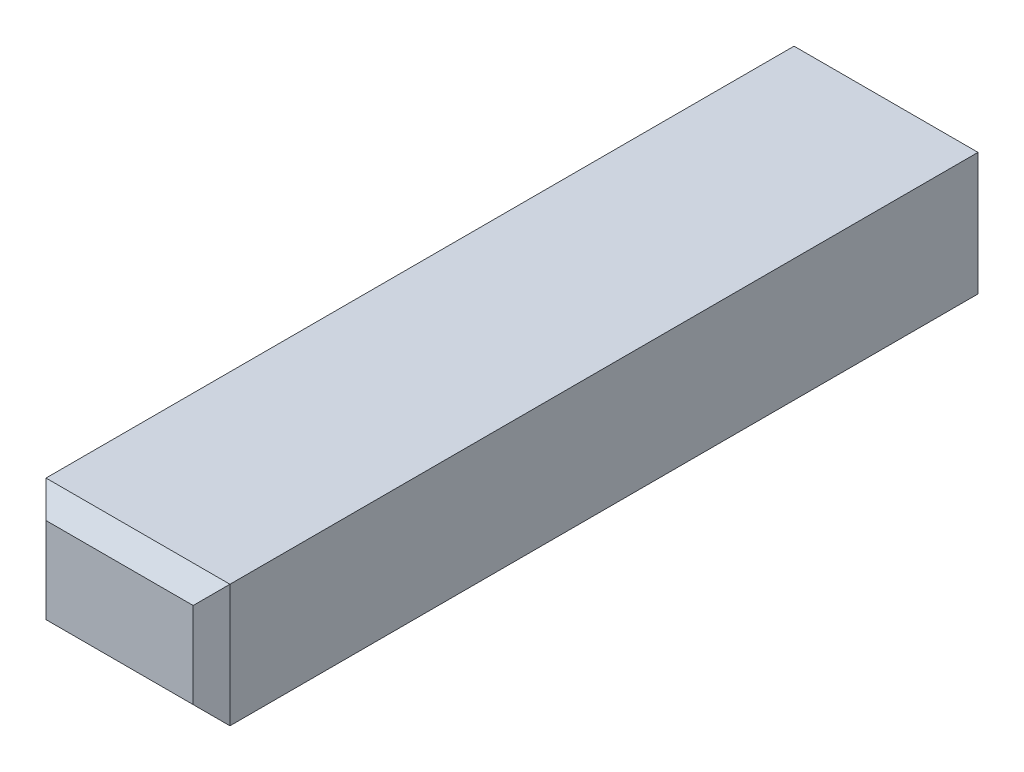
ISO-10303-21;
HEADER;
FILE_DESCRIPTION(('STEP AP214'),'2;1');
FILE_NAME('part.step','',(''),(''),'','','');
FILE_SCHEMA(('AUTOMOTIVE_DESIGN { 1 0 10303 214 1 1 1 1 }'));
ENDSEC;
DATA;
#1=APPLICATION_CONTEXT('core data for automotive mechanical design processes');
#2=APPLICATION_PROTOCOL_DEFINITION('international standard','automotive_design',2000,#1);
#3=PRODUCT_CONTEXT('',#1,'mechanical');
#4=PRODUCT('Part','Part','',(#3));
#5=PRODUCT_RELATED_PRODUCT_CATEGORY('part','',(#4));
#6=PRODUCT_DEFINITION_FORMATION('','',#4);
#7=PRODUCT_DEFINITION_CONTEXT('part definition',#1,'design');
#8=PRODUCT_DEFINITION('design','',#6,#7);
#9=PRODUCT_DEFINITION_SHAPE('','',#8);
#10=(LENGTH_UNIT() NAMED_UNIT(*) SI_UNIT(.MILLI.,.METRE.));
#11=(NAMED_UNIT(*) PLANE_ANGLE_UNIT() SI_UNIT($,.RADIAN.));
#12=(NAMED_UNIT(*) SI_UNIT($,.STERADIAN.) SOLID_ANGLE_UNIT());
#13=UNCERTAINTY_MEASURE_WITH_UNIT(LENGTH_MEASURE(1.E-05),#10,'distance_accuracy_value','');
#14=(GEOMETRIC_REPRESENTATION_CONTEXT(3) GLOBAL_UNCERTAINTY_ASSIGNED_CONTEXT((#13)) GLOBAL_UNIT_ASSIGNED_CONTEXT((#10,
#11,#12)) REPRESENTATION_CONTEXT('',''));
#15=CARTESIAN_POINT('',(0.,0.,0.));
#16=DIRECTION('',(0.,0.,1.));
#17=DIRECTION('',(1.,0.,0.));
#18=AXIS2_PLACEMENT_3D('',#15,#16,#17);
#19=CARTESIAN_POINT('',(6.,-4.,25.));
#20=DIRECTION('',(-1.,0.,0.));
#21=DIRECTION('',(0.,0.,1.));
#22=AXIS2_PLACEMENT_3D('',#19,#20,#21);
#23=PLANE('',#22);
#24=DIRECTION('',(0.,0.,-1.));
#25=VECTOR('',#24,1.);
#26=CARTESIAN_POINT('',(6.,4.,25.));
#27=LINE('',#26,#25);
#28=CARTESIAN_POINT('',(6.,4.,23.8));
#29=VERTEX_POINT('',#28);
#30=CARTESIAN_POINT('',(6.,4.,-25.));
#31=VERTEX_POINT('',#30);
#32=EDGE_CURVE('E84',#29,#31,#27,.T.);
#33=ORIENTED_EDGE('',*,*,#32,.F.);
#34=DIRECTION('',(0.,-1.,0.));
#35=VECTOR('',#34,1.);
#36=CARTESIAN_POINT('',(6.,-4.,23.8));
#37=LINE('',#36,#35);
#38=CARTESIAN_POINT('',(6.,-4.,23.8));
#39=VERTEX_POINT('',#38);
#40=EDGE_CURVE('E11',#29,#39,#37,.T.);
#41=ORIENTED_EDGE('',*,*,#40,.T.);
#42=DIRECTION('',(0.,0.,-1.));
#43=VECTOR('',#42,1.);
#44=CARTESIAN_POINT('',(6.,-4.,25.));
#45=LINE('',#44,#43);
#46=CARTESIAN_POINT('',(6.,-4.,-25.));
#47=VERTEX_POINT('',#46);
#48=EDGE_CURVE('E104',#39,#47,#45,.T.);
#49=ORIENTED_EDGE('',*,*,#48,.T.);
#50=DIRECTION('',(0.,1.,0.));
#51=VECTOR('',#50,1.);
#52=CARTESIAN_POINT('',(6.,-4.,-25.));
#53=LINE('',#52,#51);
#54=EDGE_CURVE('E99',#47,#31,#53,.T.);
#55=ORIENTED_EDGE('',*,*,#54,.T.);
#56=EDGE_LOOP('',(#33,#41,#49,#55));
#57=FACE_BOUND('',#56,.T.);
#58=ADVANCED_FACE('F32',(#57),#23,.F.);
#59=CARTESIAN_POINT('',(-6.,4.,25.));
#60=DIRECTION('',(0.,-1.,0.));
#61=DIRECTION('',(0.,0.,-1.));
#62=AXIS2_PLACEMENT_3D('',#59,#60,#61);
#63=PLANE('',#62);
#64=DIRECTION('',(0.,0.,-1.));
#65=VECTOR('',#64,1.);
#66=CARTESIAN_POINT('',(-6.,4.,25.));
#67=LINE('',#66,#65);
#68=CARTESIAN_POINT('',(-6.,4.,23.8));
#69=VERTEX_POINT('',#68);
#70=CARTESIAN_POINT('',(-6.,4.,-25.));
#71=VERTEX_POINT('',#70);
#72=EDGE_CURVE('E93',#69,#71,#67,.T.);
#73=ORIENTED_EDGE('',*,*,#72,.F.);
#74=DIRECTION('',(1.,0.,0.));
#75=VECTOR('',#74,1.);
#76=CARTESIAN_POINT('',(-6.,4.,23.8));
#77=LINE('',#76,#75);
#78=EDGE_CURVE('E41',#69,#29,#77,.T.);
#79=ORIENTED_EDGE('',*,*,#78,.T.);
#80=ORIENTED_EDGE('',*,*,#32,.T.);
#81=DIRECTION('',(-1.,0.,0.));
#82=VECTOR('',#81,1.);
#83=CARTESIAN_POINT('',(-6.,4.,-25.));
#84=LINE('',#83,#82);
#85=EDGE_CURVE('E87',#31,#71,#84,.T.);
#86=ORIENTED_EDGE('',*,*,#85,.T.);
#87=EDGE_LOOP('',(#73,#79,#80,#86));
#88=FACE_BOUND('',#87,.T.);
#89=ADVANCED_FACE('F86',(#88),#63,.F.);
#90=CARTESIAN_POINT('',(-6.,-4.,25.));
#91=DIRECTION('',(1.,0.,0.));
#92=DIRECTION('',(0.,0.,-1.));
#93=AXIS2_PLACEMENT_3D('',#90,#91,#92);
#94=PLANE('',#93);
#95=DIRECTION('',(0.,0.,-1.));
#96=VECTOR('',#95,1.);
#97=CARTESIAN_POINT('',(-6.,-4.,25.));
#98=LINE('',#97,#96);
#99=CARTESIAN_POINT('',(-6.,-4.,23.8));
#100=VERTEX_POINT('',#99);
#101=CARTESIAN_POINT('',(-6.,-4.,-25.));
#102=VERTEX_POINT('',#101);
#103=EDGE_CURVE('E114',#100,#102,#98,.T.);
#104=ORIENTED_EDGE('',*,*,#103,.F.);
#105=DIRECTION('',(0.,1.,0.));
#106=VECTOR('',#105,1.);
#107=CARTESIAN_POINT('',(-6.,-4.,23.8));
#108=LINE('',#107,#106);
#109=EDGE_CURVE('E56',#100,#69,#108,.T.);
#110=ORIENTED_EDGE('',*,*,#109,.T.);
#111=ORIENTED_EDGE('',*,*,#72,.T.);
#112=DIRECTION('',(0.,-1.,0.));
#113=VECTOR('',#112,1.);
#114=CARTESIAN_POINT('',(-6.,-4.,-25.));
#115=LINE('',#114,#113);
#116=EDGE_CURVE('E101',#71,#102,#115,.T.);
#117=ORIENTED_EDGE('',*,*,#116,.T.);
#118=EDGE_LOOP('',(#104,#110,#111,#117));
#119=FACE_BOUND('',#118,.T.);
#120=ADVANCED_FACE('F152',(#119),#94,.F.);
#121=CARTESIAN_POINT('',(-6.,-4.,25.));
#122=DIRECTION('',(0.,1.,0.));
#123=DIRECTION('',(0.,0.,1.));
#124=AXIS2_PLACEMENT_3D('',#121,#122,#123);
#125=PLANE('',#124);
#126=ORIENTED_EDGE('',*,*,#48,.F.);
#127=DIRECTION('',(-1.,0.,0.));
#128=VECTOR('',#127,1.);
#129=CARTESIAN_POINT('',(-6.,-4.,23.8));
#130=LINE('',#129,#128);
#131=EDGE_CURVE('E125',#39,#100,#130,.T.);
#132=ORIENTED_EDGE('',*,*,#131,.T.);
#133=ORIENTED_EDGE('',*,*,#103,.T.);
#134=DIRECTION('',(1.,0.,0.));
#135=VECTOR('',#134,1.);
#136=CARTESIAN_POINT('',(-6.,-4.,-25.));
#137=LINE('',#136,#135);
#138=EDGE_CURVE('E111',#102,#47,#137,.T.);
#139=ORIENTED_EDGE('',*,*,#138,.T.);
#140=EDGE_LOOP('',(#126,#132,#133,#139));
#141=FACE_BOUND('',#140,.T.);
#142=ADVANCED_FACE('F151',(#141),#125,.F.);
#143=CARTESIAN_POINT('',(0.,0.,25.));
#144=DIRECTION('',(0.,0.,-1.));
#145=DIRECTION('',(-1.,0.,0.));
#146=AXIS2_PLACEMENT_3D('',#143,#144,#145);
#147=PLANE('',#146);
#148=DIRECTION('',(0.,-1.,0.));
#149=VECTOR('',#148,1.);
#150=CARTESIAN_POINT('',(-4.8,0.,25.));
#151=LINE('',#150,#149);
#152=CARTESIAN_POINT('',(-4.8,2.8,25.));
#153=VERTEX_POINT('',#152);
#154=CARTESIAN_POINT('',(-4.8,-2.8,25.));
#155=VERTEX_POINT('',#154);
#156=EDGE_CURVE('E120',#153,#155,#151,.T.);
#157=ORIENTED_EDGE('',*,*,#156,.T.);
#158=DIRECTION('',(1.,0.,0.));
#159=VECTOR('',#158,1.);
#160=CARTESIAN_POINT('',(0.,-2.8,25.));
#161=LINE('',#160,#159);
#162=CARTESIAN_POINT('',(4.8,-2.8,25.));
#163=VERTEX_POINT('',#162);
#164=EDGE_CURVE('E122',#155,#163,#161,.T.);
#165=ORIENTED_EDGE('',*,*,#164,.T.);
#166=DIRECTION('',(0.,1.,0.));
#167=VECTOR('',#166,1.);
#168=CARTESIAN_POINT('',(4.8,0.,25.));
#169=LINE('',#168,#167);
#170=CARTESIAN_POINT('',(4.8,2.8,25.));
#171=VERTEX_POINT('',#170);
#172=EDGE_CURVE('E92',#163,#171,#169,.T.);
#173=ORIENTED_EDGE('',*,*,#172,.T.);
#174=DIRECTION('',(-1.,0.,0.));
#175=VECTOR('',#174,1.);
#176=CARTESIAN_POINT('',(0.,2.8,25.));
#177=LINE('',#176,#175);
#178=EDGE_CURVE('E118',#171,#153,#177,.T.);
#179=ORIENTED_EDGE('',*,*,#178,.T.);
#180=EDGE_LOOP('',(#157,#165,#173,#179));
#181=FACE_BOUND('',#180,.T.);
#182=ADVANCED_FACE('F144',(#181),#147,.F.);
#183=CARTESIAN_POINT('',(0.,0.,-25.));
#184=DIRECTION('',(0.,0.,-1.));
#185=DIRECTION('',(-1.,0.,0.));
#186=AXIS2_PLACEMENT_3D('',#183,#184,#185);
#187=PLANE('',#186);
#188=ORIENTED_EDGE('',*,*,#54,.F.);
#189=ORIENTED_EDGE('',*,*,#138,.F.);
#190=ORIENTED_EDGE('',*,*,#116,.F.);
#191=ORIENTED_EDGE('',*,*,#85,.F.);
#192=EDGE_LOOP('',(#188,#189,#190,#191));
#193=FACE_BOUND('',#192,.T.);
#194=ADVANCED_FACE('F97',(#193),#187,.T.);
#195=CARTESIAN_POINT('',(0.,2.8,25.));
#196=DIRECTION('',(0.,-0.707106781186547,-0.707106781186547));
#197=DIRECTION('',(-1.,0.,0.));
#198=AXIS2_PLACEMENT_3D('',#195,#196,#197);
#199=PLANE('',#198);
#200=DIRECTION('',(-0.577350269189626,-0.577350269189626,0.577350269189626));
#201=VECTOR('',#200,1.);
#202=CARTESIAN_POINT('',(3.86666666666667,1.86666666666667,25.9333333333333));
#203=LINE('',#202,#201);
#204=EDGE_CURVE('E108',#29,#171,#203,.T.);
#205=ORIENTED_EDGE('',*,*,#204,.F.);
#206=ORIENTED_EDGE('',*,*,#78,.F.);
#207=DIRECTION('',(0.577350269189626,-0.577350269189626,0.577350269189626));
#208=VECTOR('',#207,1.);
#209=CARTESIAN_POINT('',(-3.2,1.2,26.6));
#210=LINE('',#209,#208);
#211=EDGE_CURVE('E36',#153,#69,#210,.F.);
#212=ORIENTED_EDGE('',*,*,#211,.F.);
#213=ORIENTED_EDGE('',*,*,#178,.F.);
#214=EDGE_LOOP('',(#205,#206,#212,#213));
#215=FACE_BOUND('',#214,.T.);
#216=ADVANCED_FACE('F34',(#215),#199,.F.);
#217=CARTESIAN_POINT('',(-4.8,0.,25.));
#218=DIRECTION('',(0.707106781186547,0.,-0.707106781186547));
#219=DIRECTION('',(0.,-1.,0.));
#220=AXIS2_PLACEMENT_3D('',#217,#218,#219);
#221=PLANE('',#220);
#222=ORIENTED_EDGE('',*,*,#211,.T.);
#223=ORIENTED_EDGE('',*,*,#109,.F.);
#224=DIRECTION('',(0.577350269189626,0.577350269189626,0.577350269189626));
#225=VECTOR('',#224,1.);
#226=CARTESIAN_POINT('',(-3.86666666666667,-1.86666666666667,25.9333333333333));
#227=LINE('',#226,#225);
#228=EDGE_CURVE('E132',#155,#100,#227,.F.);
#229=ORIENTED_EDGE('',*,*,#228,.F.);
#230=ORIENTED_EDGE('',*,*,#156,.F.);
#231=EDGE_LOOP('',(#222,#223,#229,#230));
#232=FACE_BOUND('',#231,.T.);
#233=ADVANCED_FACE('F169',(#232),#221,.F.);
#234=CARTESIAN_POINT('',(4.8,0.,25.));
#235=DIRECTION('',(-0.707106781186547,0.,-0.707106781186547));
#236=DIRECTION('',(0.,1.,0.));
#237=AXIS2_PLACEMENT_3D('',#234,#235,#236);
#238=PLANE('',#237);
#239=ORIENTED_EDGE('',*,*,#204,.T.);
#240=ORIENTED_EDGE('',*,*,#172,.F.);
#241=DIRECTION('',(0.577350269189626,-0.577350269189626,-0.577350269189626));
#242=VECTOR('',#241,1.);
#243=CARTESIAN_POINT('',(3.86666666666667,-1.86666666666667,25.9333333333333));
#244=LINE('',#243,#242);
#245=EDGE_CURVE('E130',#39,#163,#244,.F.);
#246=ORIENTED_EDGE('',*,*,#245,.F.);
#247=ORIENTED_EDGE('',*,*,#40,.F.);
#248=EDGE_LOOP('',(#239,#240,#246,#247));
#249=FACE_BOUND('',#248,.T.);
#250=ADVANCED_FACE('F137',(#249),#238,.F.);
#251=CARTESIAN_POINT('',(0.,-2.8,25.));
#252=DIRECTION('',(0.,0.707106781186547,-0.707106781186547));
#253=DIRECTION('',(1.,0.,0.));
#254=AXIS2_PLACEMENT_3D('',#251,#252,#253);
#255=PLANE('',#254);
#256=ORIENTED_EDGE('',*,*,#228,.T.);
#257=ORIENTED_EDGE('',*,*,#131,.F.);
#258=ORIENTED_EDGE('',*,*,#245,.T.);
#259=ORIENTED_EDGE('',*,*,#164,.F.);
#260=EDGE_LOOP('',(#256,#257,#258,#259));
#261=FACE_BOUND('',#260,.T.);
#262=ADVANCED_FACE('F148',(#261),#255,.F.);
#263=CLOSED_SHELL('',(#58,#89,#120,#142,#182,#194,#216,#233,#250,#262));
#264=MANIFOLD_SOLID_BREP('B2',#263);
#265=ADVANCED_BREP_SHAPE_REPRESENTATION('',(#18,#264),#14);
#266=SHAPE_DEFINITION_REPRESENTATION(#9,#265);
ENDSEC;
END-ISO-10303-21;
